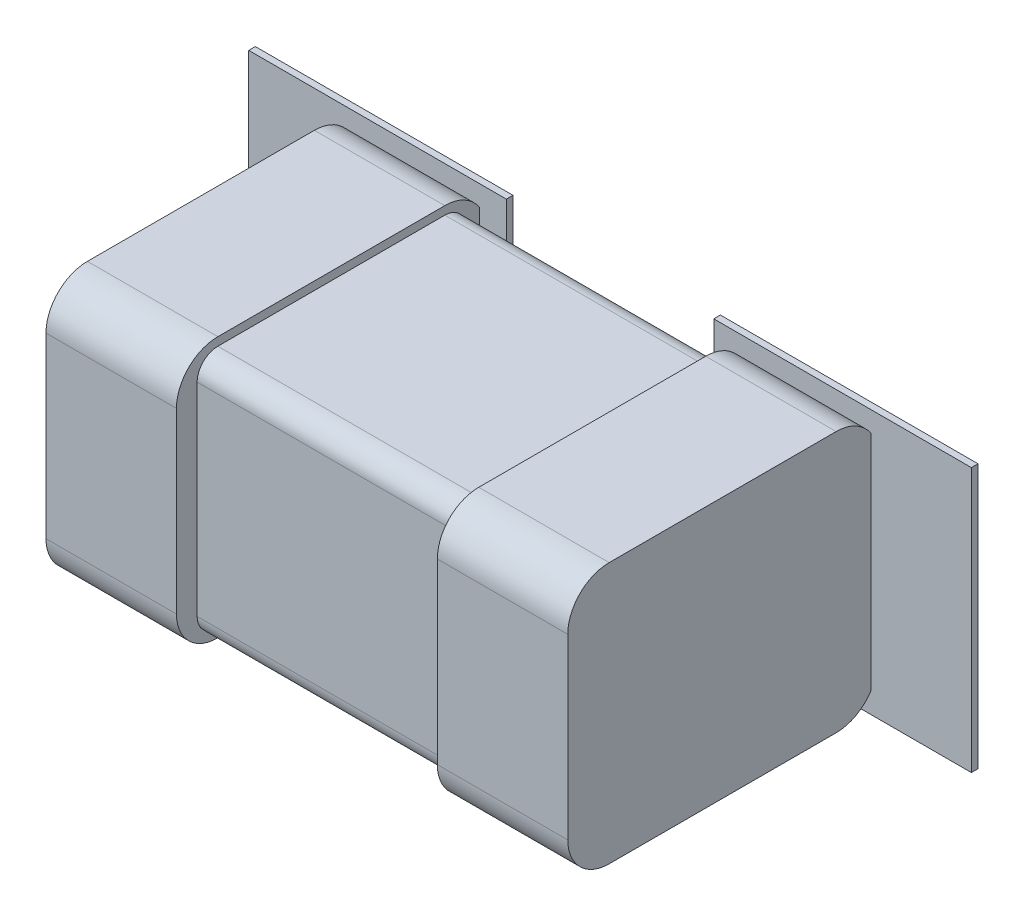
ISO-10303-21;
HEADER;
FILE_DESCRIPTION(('STEP AP214'),'2;1');
FILE_NAME('part.step','',(''),(''),'','','');
FILE_SCHEMA(('AUTOMOTIVE_DESIGN { 1 0 10303 214 1 1 1 1 }'));
ENDSEC;
DATA;
#1=APPLICATION_CONTEXT('core data for automotive mechanical design processes');
#2=APPLICATION_PROTOCOL_DEFINITION('international standard','automotive_design',2000,#1);
#3=PRODUCT_CONTEXT('',#1,'mechanical');
#4=PRODUCT('Part','Part','',(#3));
#5=PRODUCT_RELATED_PRODUCT_CATEGORY('part','',(#4));
#6=PRODUCT_DEFINITION_FORMATION('','',#4);
#7=PRODUCT_DEFINITION_CONTEXT('part definition',#1,'design');
#8=PRODUCT_DEFINITION('design','',#6,#7);
#9=PRODUCT_DEFINITION_SHAPE('','',#8);
#10=(LENGTH_UNIT() NAMED_UNIT(*) SI_UNIT(.MILLI.,.METRE.));
#11=(NAMED_UNIT(*) PLANE_ANGLE_UNIT() SI_UNIT($,.RADIAN.));
#12=(NAMED_UNIT(*) SI_UNIT($,.STERADIAN.) SOLID_ANGLE_UNIT());
#13=UNCERTAINTY_MEASURE_WITH_UNIT(LENGTH_MEASURE(1.E-05),#10,'distance_accuracy_value','');
#14=(GEOMETRIC_REPRESENTATION_CONTEXT(3) GLOBAL_UNCERTAINTY_ASSIGNED_CONTEXT((#13)) GLOBAL_UNIT_ASSIGNED_CONTEXT((#10,
#11,#12)) REPRESENTATION_CONTEXT('',''));
#15=CARTESIAN_POINT('',(0.,0.,0.));
#16=DIRECTION('',(0.,0.,1.));
#17=DIRECTION('',(1.,0.,0.));
#18=AXIS2_PLACEMENT_3D('',#15,#16,#17);
#19=CARTESIAN_POINT('',(0.,0.,0.0762));
#20=DIRECTION('',(0.,0.,1.));
#21=DIRECTION('',(1.,0.,0.));
#22=AXIS2_PLACEMENT_3D('',#19,#20,#21);
#23=PLANE('',#22);
#24=DIRECTION('',(0.,1.,0.));
#25=VECTOR('',#24,1.);
#26=CARTESIAN_POINT('',(0.318008,0.405003,0.0762));
#27=LINE('',#26,#25);
#28=CARTESIAN_POINT('',(0.318008,0.405003,0.0762));
#29=VERTEX_POINT('',#28);
#30=CARTESIAN_POINT('',(0.318008,-0.405003,0.0762));
#31=VERTEX_POINT('',#30);
#32=EDGE_CURVE('E228',#29,#31,#27,.F.);
#33=ORIENTED_EDGE('',*,*,#32,.F.);
#34=DIRECTION('',(1.,0.,0.));
#35=VECTOR('',#34,1.);
#36=CARTESIAN_POINT('',(1.1079988,0.405003,0.0762));
#37=LINE('',#36,#35);
#38=CARTESIAN_POINT('',(1.1079988,0.405003,0.0762));
#39=VERTEX_POINT('',#38);
#40=EDGE_CURVE('E215',#39,#29,#37,.F.);
#41=ORIENTED_EDGE('',*,*,#40,.F.);
#42=DIRECTION('',(0.,1.,0.));
#43=VECTOR('',#42,1.);
#44=CARTESIAN_POINT('',(1.1079988,-0.405003,0.0762));
#45=LINE('',#44,#43);
#46=CARTESIAN_POINT('',(1.1079988,-0.405003,0.0762));
#47=VERTEX_POINT('',#46);
#48=EDGE_CURVE('E356',#47,#39,#45,.T.);
#49=ORIENTED_EDGE('',*,*,#48,.F.);
#50=DIRECTION('',(1.,0.,0.));
#51=VECTOR('',#50,1.);
#52=CARTESIAN_POINT('',(0.318008,-0.405003,0.0762));
#53=LINE('',#52,#51);
#54=EDGE_CURVE('E229',#31,#47,#53,.T.);
#55=ORIENTED_EDGE('',*,*,#54,.F.);
#56=EDGE_LOOP('',(#33,#41,#49,#55));
#57=FACE_BOUND('',#56,.T.);
#58=ADVANCED_FACE('F16',(#57),#23,.F.);
#59=CARTESIAN_POINT('',(1.1079988,0.405003,0.0762));
#60=DIRECTION('',(0.,1.,0.));
#61=DIRECTION('',(0.,0.,1.));
#62=AXIS2_PLACEMENT_3D('',#59,#60,#61);
#63=PLANE('',#62);
#64=DIRECTION('',(0.,0.,-1.));
#65=VECTOR('',#64,1.);
#66=CARTESIAN_POINT('',(1.1079988,0.405003,0.0762));
#67=LINE('',#66,#65);
#68=CARTESIAN_POINT('',(1.1079988,0.405003,0.09652));
#69=VERTEX_POINT('',#68);
#70=EDGE_CURVE('E222',#39,#69,#67,.F.);
#71=ORIENTED_EDGE('',*,*,#70,.F.);
#72=ORIENTED_EDGE('',*,*,#40,.T.);
#73=DIRECTION('',(0.,0.,1.));
#74=VECTOR('',#73,1.);
#75=CARTESIAN_POINT('',(0.318008,0.405003,0.0762));
#76=LINE('',#75,#74);
#77=CARTESIAN_POINT('',(0.318008,0.405003,0.09652));
#78=VERTEX_POINT('',#77);
#79=EDGE_CURVE('E219',#78,#29,#76,.F.);
#80=ORIENTED_EDGE('',*,*,#79,.F.);
#81=DIRECTION('',(1.,0.,0.));
#82=VECTOR('',#81,1.);
#83=CARTESIAN_POINT('',(0.,0.405003,0.09652));
#84=LINE('',#83,#82);
#85=EDGE_CURVE('E354',#69,#78,#84,.F.);
#86=ORIENTED_EDGE('',*,*,#85,.F.);
#87=EDGE_LOOP('',(#71,#72,#80,#86));
#88=FACE_BOUND('',#87,.T.);
#89=ADVANCED_FACE('F217',(#88),#63,.T.);
#90=CARTESIAN_POINT('',(0.318008,0.405003,0.0762));
#91=DIRECTION('',(-1.,0.,0.));
#92=DIRECTION('',(0.,0.,1.));
#93=AXIS2_PLACEMENT_3D('',#90,#91,#92);
#94=PLANE('',#93);
#95=ORIENTED_EDGE('',*,*,#79,.T.);
#96=ORIENTED_EDGE('',*,*,#32,.T.);
#97=DIRECTION('',(0.,0.,-1.));
#98=VECTOR('',#97,1.);
#99=CARTESIAN_POINT('',(0.318008,-0.405003,0.0762));
#100=LINE('',#99,#98);
#101=CARTESIAN_POINT('',(0.318008,-0.405003,0.09652));
#102=VERTEX_POINT('',#101);
#103=EDGE_CURVE('E232',#102,#31,#100,.T.);
#104=ORIENTED_EDGE('',*,*,#103,.F.);
#105=DIRECTION('',(0.,1.,0.));
#106=VECTOR('',#105,1.);
#107=CARTESIAN_POINT('',(0.318008,0.,0.09652));
#108=LINE('',#107,#106);
#109=EDGE_CURVE('E236',#78,#102,#108,.F.);
#110=ORIENTED_EDGE('',*,*,#109,.F.);
#111=EDGE_LOOP('',(#95,#96,#104,#110));
#112=FACE_BOUND('',#111,.T.);
#113=ADVANCED_FACE('F234',(#112),#94,.T.);
#114=CARTESIAN_POINT('',(0.318008,-0.405003,0.0762));
#115=DIRECTION('',(0.,-1.,0.));
#116=DIRECTION('',(0.,0.,-1.));
#117=AXIS2_PLACEMENT_3D('',#114,#115,#116);
#118=PLANE('',#117);
#119=ORIENTED_EDGE('',*,*,#103,.T.);
#120=ORIENTED_EDGE('',*,*,#54,.T.);
#121=DIRECTION('',(0.,0.,-1.));
#122=VECTOR('',#121,1.);
#123=CARTESIAN_POINT('',(1.1079988,-0.405003,0.0762));
#124=LINE('',#123,#122);
#125=CARTESIAN_POINT('',(1.1079988,-0.405003,0.09652));
#126=VERTEX_POINT('',#125);
#127=EDGE_CURVE('E191',#126,#47,#124,.T.);
#128=ORIENTED_EDGE('',*,*,#127,.F.);
#129=DIRECTION('',(1.,0.,0.));
#130=VECTOR('',#129,1.);
#131=CARTESIAN_POINT('',(0.,-0.405003,0.09652));
#132=LINE('',#131,#130);
#133=EDGE_CURVE('E350',#102,#126,#132,.T.);
#134=ORIENTED_EDGE('',*,*,#133,.F.);
#135=EDGE_LOOP('',(#119,#120,#128,#134));
#136=FACE_BOUND('',#135,.T.);
#137=ADVANCED_FACE('F367',(#136),#118,.T.);
#138=CARTESIAN_POINT('',(1.1079988,-0.405003,0.0762));
#139=DIRECTION('',(1.,0.,0.));
#140=DIRECTION('',(0.,0.,-1.));
#141=AXIS2_PLACEMENT_3D('',#138,#139,#140);
#142=PLANE('',#141);
#143=ORIENTED_EDGE('',*,*,#127,.T.);
#144=ORIENTED_EDGE('',*,*,#48,.T.);
#145=ORIENTED_EDGE('',*,*,#70,.T.);
#146=DIRECTION('',(0.,1.,0.));
#147=VECTOR('',#146,1.);
#148=CARTESIAN_POINT('',(1.1079988,0.,0.09652));
#149=LINE('',#148,#147);
#150=EDGE_CURVE('E347',#126,#69,#149,.T.);
#151=ORIENTED_EDGE('',*,*,#150,.F.);
#152=EDGE_LOOP('',(#143,#144,#145,#151));
#153=FACE_BOUND('',#152,.T.);
#154=ADVANCED_FACE('F371',(#153),#142,.T.);
#155=CARTESIAN_POINT('',(0.800000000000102,-0.399999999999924,0.0762));
#156=DIRECTION('',(1.,0.,0.));
#157=DIRECTION('',(0.,0.,-1.));
#158=AXIS2_PLACEMENT_3D('',#155,#156,#157);
#159=PLANE('',#158);
#160=CARTESIAN_POINT('',(0.800000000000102,-0.272999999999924,0.2032));
#161=DIRECTION('',(1.,0.,0.));
#162=DIRECTION('',(0.,0.,-1.));
#163=AXIS2_PLACEMENT_3D('',#160,#161,#162);
#164=CIRCLE('',#163,0.127);
#165=CARTESIAN_POINT('',(0.800000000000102,-0.341908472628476,0.0965199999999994));
#166=VERTEX_POINT('',#165);
#167=CARTESIAN_POINT('',(0.800000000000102,-0.399999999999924,0.2032));
#168=VERTEX_POINT('',#167);
#169=EDGE_CURVE('E318',#166,#168,#164,.F.);
#170=ORIENTED_EDGE('',*,*,#169,.F.);
#171=DIRECTION('',(0.,1.,0.));
#172=VECTOR('',#171,1.);
#173=CARTESIAN_POINT('',(0.800000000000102,0.,0.09652));
#174=LINE('',#173,#172);
#175=CARTESIAN_POINT('',(0.800000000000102,0.341908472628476,0.0965199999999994));
#176=VERTEX_POINT('',#175);
#177=EDGE_CURVE('E182',#176,#166,#174,.F.);
#178=ORIENTED_EDGE('',*,*,#177,.F.);
#179=CARTESIAN_POINT('',(0.800000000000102,0.272999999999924,0.2032));
#180=DIRECTION('',(1.,0.,0.));
#181=DIRECTION('',(0.,0.,-1.));
#182=AXIS2_PLACEMENT_3D('',#179,#180,#181);
#183=CIRCLE('',#182,0.127);
#184=CARTESIAN_POINT('',(0.800000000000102,0.399999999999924,0.2032));
#185=VERTEX_POINT('',#184);
#186=EDGE_CURVE('E19',#185,#176,#183,.F.);
#187=ORIENTED_EDGE('',*,*,#186,.F.);
#188=DIRECTION('',(0.,0.,1.));
#189=VECTOR('',#188,1.);
#190=CARTESIAN_POINT('',(0.800000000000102,0.399999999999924,0.0762));
#191=LINE('',#190,#189);
#192=CARTESIAN_POINT('',(0.800000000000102,0.399999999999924,0.89916));
#193=VERTEX_POINT('',#192);
#194=EDGE_CURVE('E336',#193,#185,#191,.F.);
#195=ORIENTED_EDGE('',*,*,#194,.F.);
#196=CARTESIAN_POINT('',(0.800000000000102,0.272999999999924,0.89916));
#197=DIRECTION('',(-1.,0.,0.));
#198=DIRECTION('',(0.,0.,1.));
#199=AXIS2_PLACEMENT_3D('',#196,#197,#198);
#200=CIRCLE('',#199,0.127);
#201=CARTESIAN_POINT('',(0.800000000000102,0.272999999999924,1.02616));
#202=VERTEX_POINT('',#201);
#203=EDGE_CURVE('E326',#202,#193,#200,.T.);
#204=ORIENTED_EDGE('',*,*,#203,.F.);
#205=DIRECTION('',(0.,1.,0.));
#206=VECTOR('',#205,1.);
#207=CARTESIAN_POINT('',(0.800000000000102,0.,1.02616));
#208=LINE('',#207,#206);
#209=CARTESIAN_POINT('',(0.800000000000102,-0.272999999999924,1.02616));
#210=VERTEX_POINT('',#209);
#211=EDGE_CURVE('E333',#210,#202,#208,.T.);
#212=ORIENTED_EDGE('',*,*,#211,.F.);
#213=CARTESIAN_POINT('',(0.800000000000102,-0.272999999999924,0.89916));
#214=DIRECTION('',(1.,0.,0.));
#215=DIRECTION('',(0.,0.,-1.));
#216=AXIS2_PLACEMENT_3D('',#213,#214,#215);
#217=CIRCLE('',#216,0.127);
#218=CARTESIAN_POINT('',(0.800000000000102,-0.399999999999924,0.89916));
#219=VERTEX_POINT('',#218);
#220=EDGE_CURVE('E322',#219,#210,#217,.F.);
#221=ORIENTED_EDGE('',*,*,#220,.F.);
#222=DIRECTION('',(0.,0.,-1.));
#223=VECTOR('',#222,1.);
#224=CARTESIAN_POINT('',(0.800000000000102,-0.399999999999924,0.0762));
#225=LINE('',#224,#223);
#226=EDGE_CURVE('E324',#168,#219,#225,.F.);
#227=ORIENTED_EDGE('',*,*,#226,.F.);
#228=EDGE_LOOP('',(#170,#178,#187,#195,#204,#212,#221,#227));
#229=FACE_BOUND('',#228,.T.);
#230=ADVANCED_FACE('F373',(#229),#159,.T.);
#231=CARTESIAN_POINT('',(0.,0.,0.09652));
#232=DIRECTION('',(0.,0.,1.));
#233=DIRECTION('',(1.,0.,0.));
#234=AXIS2_PLACEMENT_3D('',#231,#232,#233);
#235=PLANE('',#234);
#236=DIRECTION('',(1.,0.,0.));
#237=VECTOR('',#236,1.);
#238=CARTESIAN_POINT('',(0.800000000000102,0.341908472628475,0.0965199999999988));
#239=LINE('',#238,#237);
#240=CARTESIAN_POINT('',(0.399999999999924,0.341908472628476,0.0965199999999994));
#241=VERTEX_POINT('',#240);
#242=EDGE_CURVE('E344',#176,#241,#239,.F.);
#243=ORIENTED_EDGE('',*,*,#242,.F.);
#244=ORIENTED_EDGE('',*,*,#177,.T.);
#245=DIRECTION('',(1.,0.,0.));
#246=VECTOR('',#245,1.);
#247=CARTESIAN_POINT('',(0.800000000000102,-0.341908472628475,0.0965199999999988));
#248=LINE('',#247,#246);
#249=CARTESIAN_POINT('',(0.399999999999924,-0.341908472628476,0.0965199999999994));
#250=VERTEX_POINT('',#249);
#251=EDGE_CURVE('E321',#250,#166,#248,.T.);
#252=ORIENTED_EDGE('',*,*,#251,.F.);
#253=DIRECTION('',(0.,1.,0.));
#254=VECTOR('',#253,1.);
#255=CARTESIAN_POINT('',(0.399999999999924,0.374599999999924,0.09652));
#256=LINE('',#255,#254);
#257=EDGE_CURVE('E317',#250,#241,#256,.T.);
#258=ORIENTED_EDGE('',*,*,#257,.T.);
#259=EDGE_LOOP('',(#243,#244,#252,#258));
#260=FACE_BOUND('',#259,.T.);
#261=ORIENTED_EDGE('',*,*,#133,.T.);
#262=ORIENTED_EDGE('',*,*,#150,.T.);
#263=ORIENTED_EDGE('',*,*,#85,.T.);
#264=ORIENTED_EDGE('',*,*,#109,.T.);
#265=EDGE_LOOP('',(#261,#262,#263,#264));
#266=FACE_BOUND('',#265,.T.);
#267=ADVANCED_FACE('F369',(#260,#266),#235,.T.);
#268=CARTESIAN_POINT('',(0.800000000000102,0.272999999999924,0.2032));
#269=DIRECTION('',(1.,0.,0.));
#270=DIRECTION('',(0.,0.,-1.));
#271=AXIS2_PLACEMENT_3D('',#268,#269,#270);
#272=CYLINDRICAL_SURFACE('',#271,0.127);
#273=DIRECTION('',(1.,0.,0.));
#274=VECTOR('',#273,1.);
#275=CARTESIAN_POINT('',(0.800000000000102,0.399999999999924,0.2032));
#276=LINE('',#275,#274);
#277=CARTESIAN_POINT('',(0.399999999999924,0.399999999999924,0.2032));
#278=VERTEX_POINT('',#277);
#279=EDGE_CURVE('E329',#185,#278,#276,.F.);
#280=ORIENTED_EDGE('',*,*,#279,.F.);
#281=ORIENTED_EDGE('',*,*,#186,.T.);
#282=ORIENTED_EDGE('',*,*,#242,.T.);
#283=CARTESIAN_POINT('',(0.399999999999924,0.272999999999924,0.2032));
#284=DIRECTION('',(1.,0.,0.));
#285=DIRECTION('',(0.,0.,-1.));
#286=AXIS2_PLACEMENT_3D('',#283,#284,#285);
#287=CIRCLE('',#286,0.127);
#288=EDGE_CURVE('E315',#241,#278,#287,.T.);
#289=ORIENTED_EDGE('',*,*,#288,.T.);
#290=EDGE_LOOP('',(#280,#281,#282,#289));
#291=FACE_BOUND('',#290,.T.);
#292=ADVANCED_FACE('F502',(#291),#272,.T.);
#293=CARTESIAN_POINT('',(0.800000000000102,0.399999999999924,0.0762));
#294=DIRECTION('',(0.,1.,0.));
#295=DIRECTION('',(0.,0.,1.));
#296=AXIS2_PLACEMENT_3D('',#293,#294,#295);
#297=PLANE('',#296);
#298=ORIENTED_EDGE('',*,*,#194,.T.);
#299=ORIENTED_EDGE('',*,*,#279,.T.);
#300=DIRECTION('',(0.,0.,-1.));
#301=VECTOR('',#300,1.);
#302=CARTESIAN_POINT('',(0.399999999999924,0.399999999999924,1.02616));
#303=LINE('',#302,#301);
#304=CARTESIAN_POINT('',(0.399999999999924,0.399999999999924,0.89916));
#305=VERTEX_POINT('',#304);
#306=EDGE_CURVE('E314',#278,#305,#303,.F.);
#307=ORIENTED_EDGE('',*,*,#306,.T.);
#308=DIRECTION('',(-1.,0.,0.));
#309=VECTOR('',#308,1.);
#310=CARTESIAN_POINT('',(0.803760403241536,0.399999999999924,0.89916));
#311=LINE('',#310,#309);
#312=EDGE_CURVE('E328',#193,#305,#311,.T.);
#313=ORIENTED_EDGE('',*,*,#312,.F.);
#314=EDGE_LOOP('',(#298,#299,#307,#313));
#315=FACE_BOUND('',#314,.T.);
#316=ADVANCED_FACE('F499',(#315),#297,.T.);
#317=CARTESIAN_POINT('',(0.803760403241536,0.272999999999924,0.89916));
#318=DIRECTION('',(-1.,0.,0.));
#319=DIRECTION('',(0.,0.,1.));
#320=AXIS2_PLACEMENT_3D('',#317,#318,#319);
#321=CYLINDRICAL_SURFACE('',#320,0.127);
#322=ORIENTED_EDGE('',*,*,#312,.T.);
#323=CARTESIAN_POINT('',(0.399999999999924,0.272999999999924,0.89916));
#324=DIRECTION('',(-1.,0.,0.));
#325=DIRECTION('',(0.,0.,1.));
#326=AXIS2_PLACEMENT_3D('',#323,#324,#325);
#327=CIRCLE('',#326,0.127);
#328=CARTESIAN_POINT('',(0.399999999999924,0.272999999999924,1.02616));
#329=VERTEX_POINT('',#328);
#330=EDGE_CURVE('E312',#305,#329,#327,.F.);
#331=ORIENTED_EDGE('',*,*,#330,.T.);
#332=DIRECTION('',(1.,0.,0.));
#333=VECTOR('',#332,1.);
#334=CARTESIAN_POINT('',(0.,0.272999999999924,1.02616));
#335=LINE('',#334,#333);
#336=EDGE_CURVE('E362',#202,#329,#335,.F.);
#337=ORIENTED_EDGE('',*,*,#336,.F.);
#338=ORIENTED_EDGE('',*,*,#203,.T.);
#339=EDGE_LOOP('',(#322,#331,#337,#338));
#340=FACE_BOUND('',#339,.T.);
#341=ADVANCED_FACE('F495',(#340),#321,.T.);
#342=CARTESIAN_POINT('',(0.,0.,1.02616));
#343=DIRECTION('',(0.,0.,1.));
#344=DIRECTION('',(1.,0.,0.));
#345=AXIS2_PLACEMENT_3D('',#342,#343,#344);
#346=PLANE('',#345);
#347=ORIENTED_EDGE('',*,*,#211,.T.);
#348=ORIENTED_EDGE('',*,*,#336,.T.);
#349=DIRECTION('',(0.,1.,0.));
#350=VECTOR('',#349,1.);
#351=CARTESIAN_POINT('',(0.399999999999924,0.374599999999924,1.02616));
#352=LINE('',#351,#350);
#353=CARTESIAN_POINT('',(0.399999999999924,-0.272999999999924,1.02616));
#354=VERTEX_POINT('',#353);
#355=EDGE_CURVE('E311',#329,#354,#352,.F.);
#356=ORIENTED_EDGE('',*,*,#355,.T.);
#357=DIRECTION('',(1.,0.,0.));
#358=VECTOR('',#357,1.);
#359=CARTESIAN_POINT('',(-0.80391086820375,-0.272999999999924,1.02616));
#360=LINE('',#359,#358);
#361=EDGE_CURVE('E325',#210,#354,#360,.F.);
#362=ORIENTED_EDGE('',*,*,#361,.F.);
#363=EDGE_LOOP('',(#347,#348,#356,#362));
#364=FACE_BOUND('',#363,.T.);
#365=ADVANCED_FACE('F491',(#364),#346,.T.);
#366=CARTESIAN_POINT('',(-0.80391086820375,-0.272999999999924,0.89916));
#367=DIRECTION('',(1.,0.,0.));
#368=DIRECTION('',(0.,0.,-1.));
#369=AXIS2_PLACEMENT_3D('',#366,#367,#368);
#370=CYLINDRICAL_SURFACE('',#369,0.127);
#371=DIRECTION('',(1.,0.,0.));
#372=VECTOR('',#371,1.);
#373=CARTESIAN_POINT('',(-0.800000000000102,-0.399999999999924,0.89916));
#374=LINE('',#373,#372);
#375=CARTESIAN_POINT('',(0.399999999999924,-0.399999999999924,0.89916));
#376=VERTEX_POINT('',#375);
#377=EDGE_CURVE('E360',#219,#376,#374,.F.);
#378=ORIENTED_EDGE('',*,*,#377,.F.);
#379=ORIENTED_EDGE('',*,*,#220,.T.);
#380=ORIENTED_EDGE('',*,*,#361,.T.);
#381=CARTESIAN_POINT('',(0.399999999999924,-0.272999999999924,0.89916));
#382=DIRECTION('',(1.,0.,0.));
#383=DIRECTION('',(0.,0.,-1.));
#384=AXIS2_PLACEMENT_3D('',#381,#382,#383);
#385=CIRCLE('',#384,0.127);
#386=EDGE_CURVE('E309',#354,#376,#385,.T.);
#387=ORIENTED_EDGE('',*,*,#386,.T.);
#388=EDGE_LOOP('',(#378,#379,#380,#387));
#389=FACE_BOUND('',#388,.T.);
#390=ADVANCED_FACE('F487',(#389),#370,.T.);
#391=CARTESIAN_POINT('',(-0.800000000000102,-0.399999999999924,0.0762));
#392=DIRECTION('',(0.,-1.,0.));
#393=DIRECTION('',(0.,0.,-1.));
#394=AXIS2_PLACEMENT_3D('',#391,#392,#393);
#395=PLANE('',#394);
#396=DIRECTION('',(0.,0.,-1.));
#397=VECTOR('',#396,1.);
#398=CARTESIAN_POINT('',(0.399999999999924,-0.399999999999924,1.02616));
#399=LINE('',#398,#397);
#400=CARTESIAN_POINT('',(0.399999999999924,-0.399999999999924,0.2032));
#401=VERTEX_POINT('',#400);
#402=EDGE_CURVE('E308',#376,#401,#399,.T.);
#403=ORIENTED_EDGE('',*,*,#402,.T.);
#404=DIRECTION('',(1.,0.,0.));
#405=VECTOR('',#404,1.);
#406=CARTESIAN_POINT('',(0.800000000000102,-0.399999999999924,0.2032));
#407=LINE('',#406,#405);
#408=EDGE_CURVE('E525',#168,#401,#407,.F.);
#409=ORIENTED_EDGE('',*,*,#408,.F.);
#410=ORIENTED_EDGE('',*,*,#226,.T.);
#411=ORIENTED_EDGE('',*,*,#377,.T.);
#412=EDGE_LOOP('',(#403,#409,#410,#411));
#413=FACE_BOUND('',#412,.T.);
#414=ADVANCED_FACE('F483',(#413),#395,.T.);
#415=CARTESIAN_POINT('',(0.800000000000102,-0.272999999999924,0.2032));
#416=DIRECTION('',(1.,0.,0.));
#417=DIRECTION('',(0.,0.,-1.));
#418=AXIS2_PLACEMENT_3D('',#415,#416,#417);
#419=CYLINDRICAL_SURFACE('',#418,0.127);
#420=ORIENTED_EDGE('',*,*,#251,.T.);
#421=ORIENTED_EDGE('',*,*,#169,.T.);
#422=ORIENTED_EDGE('',*,*,#408,.T.);
#423=CARTESIAN_POINT('',(0.399999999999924,-0.272999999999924,0.2032));
#424=DIRECTION('',(1.,0.,0.));
#425=DIRECTION('',(0.,0.,-1.));
#426=AXIS2_PLACEMENT_3D('',#423,#424,#425);
#427=CIRCLE('',#426,0.127);
#428=EDGE_CURVE('E305',#401,#250,#427,.T.);
#429=ORIENTED_EDGE('',*,*,#428,.T.);
#430=EDGE_LOOP('',(#420,#421,#422,#429));
#431=FACE_BOUND('',#430,.T.);
#432=ADVANCED_FACE('F479',(#431),#419,.T.);
#433=CARTESIAN_POINT('',(0.399999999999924,0.374599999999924,1.02616));
#434=DIRECTION('',(1.,0.,0.));
#435=DIRECTION('',(0.,0.,-1.));
#436=AXIS2_PLACEMENT_3D('',#433,#434,#435);
#437=PLANE('',#436);
#438=DIRECTION('',(0.,0.,1.));
#439=VECTOR('',#438,1.);
#440=CARTESIAN_POINT('',(0.399999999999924,-0.374599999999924,1.02616));
#441=LINE('',#440,#439);
#442=CARTESIAN_POINT('',(0.399999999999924,-0.374599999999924,0.89916));
#443=VERTEX_POINT('',#442);
#444=CARTESIAN_POINT('',(0.399999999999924,-0.374599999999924,0.2032));
#445=VERTEX_POINT('',#444);
#446=EDGE_CURVE('E294',#443,#445,#441,.F.);
#447=ORIENTED_EDGE('',*,*,#446,.T.);
#448=CARTESIAN_POINT('',(0.399999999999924,-0.311099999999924,0.2032));
#449=DIRECTION('',(1.,0.,0.));
#450=DIRECTION('',(0.,0.,-1.));
#451=AXIS2_PLACEMENT_3D('',#448,#449,#450);
#452=CIRCLE('',#451,0.0635);
#453=CARTESIAN_POINT('',(0.399999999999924,-0.311099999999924,0.1397));
#454=VERTEX_POINT('',#453);
#455=EDGE_CURVE('E290',#454,#445,#452,.F.);
#456=ORIENTED_EDGE('',*,*,#455,.F.);
#457=DIRECTION('',(0.,1.,0.));
#458=VECTOR('',#457,1.);
#459=CARTESIAN_POINT('',(0.399999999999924,0.374599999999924,0.1397));
#460=LINE('',#459,#458);
#461=CARTESIAN_POINT('',(0.399999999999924,0.311099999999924,0.1397));
#462=VERTEX_POINT('',#461);
#463=EDGE_CURVE('E536',#454,#462,#460,.T.);
#464=ORIENTED_EDGE('',*,*,#463,.T.);
#465=CARTESIAN_POINT('',(0.399999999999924,0.311099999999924,0.2032));
#466=DIRECTION('',(-1.,0.,0.));
#467=DIRECTION('',(0.,0.,1.));
#468=AXIS2_PLACEMENT_3D('',#465,#466,#467);
#469=CIRCLE('',#468,0.0635);
#470=CARTESIAN_POINT('',(0.399999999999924,0.374599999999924,0.2032));
#471=VERTEX_POINT('',#470);
#472=EDGE_CURVE('E285',#471,#462,#469,.T.);
#473=ORIENTED_EDGE('',*,*,#472,.F.);
#474=DIRECTION('',(0.,0.,-1.));
#475=VECTOR('',#474,1.);
#476=CARTESIAN_POINT('',(0.399999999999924,0.374599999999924,1.02616));
#477=LINE('',#476,#475);
#478=CARTESIAN_POINT('',(0.399999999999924,0.374599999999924,0.89916));
#479=VERTEX_POINT('',#478);
#480=EDGE_CURVE('E304',#471,#479,#477,.F.);
#481=ORIENTED_EDGE('',*,*,#480,.T.);
#482=CARTESIAN_POINT('',(0.399999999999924,0.311099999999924,0.89916));
#483=DIRECTION('',(1.,0.,0.));
#484=DIRECTION('',(0.,0.,-1.));
#485=AXIS2_PLACEMENT_3D('',#482,#483,#484);
#486=CIRCLE('',#485,0.0635);
#487=CARTESIAN_POINT('',(0.399999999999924,0.311099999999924,0.96266));
#488=VERTEX_POINT('',#487);
#489=EDGE_CURVE('E300',#488,#479,#486,.F.);
#490=ORIENTED_EDGE('',*,*,#489,.F.);
#491=DIRECTION('',(0.,1.,0.));
#492=VECTOR('',#491,1.);
#493=CARTESIAN_POINT('',(0.399999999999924,0.374599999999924,0.96266));
#494=LINE('',#493,#492);
#495=CARTESIAN_POINT('',(0.399999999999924,-0.311099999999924,0.96266));
#496=VERTEX_POINT('',#495);
#497=EDGE_CURVE('E299',#488,#496,#494,.F.);
#498=ORIENTED_EDGE('',*,*,#497,.T.);
#499=CARTESIAN_POINT('',(0.399999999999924,-0.311099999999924,0.89916));
#500=DIRECTION('',(-1.,0.,0.));
#501=DIRECTION('',(0.,0.,1.));
#502=AXIS2_PLACEMENT_3D('',#499,#500,#501);
#503=CIRCLE('',#502,0.0635);
#504=EDGE_CURVE('E295',#443,#496,#503,.T.);
#505=ORIENTED_EDGE('',*,*,#504,.F.);
#506=EDGE_LOOP('',(#447,#456,#464,#473,#481,#490,#498,#505));
#507=FACE_BOUND('',#506,.T.);
#508=ORIENTED_EDGE('',*,*,#402,.F.);
#509=ORIENTED_EDGE('',*,*,#386,.F.);
#510=ORIENTED_EDGE('',*,*,#355,.F.);
#511=ORIENTED_EDGE('',*,*,#330,.F.);
#512=ORIENTED_EDGE('',*,*,#306,.F.);
#513=ORIENTED_EDGE('',*,*,#288,.F.);
#514=ORIENTED_EDGE('',*,*,#257,.F.);
#515=ORIENTED_EDGE('',*,*,#428,.F.);
#516=EDGE_LOOP('',(#508,#509,#510,#511,#512,#513,#514,#515));
#517=FACE_BOUND('',#516,.T.);
#518=ADVANCED_FACE('F475',(#507,#517),#437,.F.);
#519=CARTESIAN_POINT('',(0.,0.,0.0762));
#520=DIRECTION('',(0.,0.,1.));
#521=DIRECTION('',(1.,0.,0.));
#522=AXIS2_PLACEMENT_3D('',#519,#520,#521);
#523=PLANE('',#522);
#524=DIRECTION('',(0.,1.,0.));
#525=VECTOR('',#524,1.);
#526=CARTESIAN_POINT('',(-0.318008,-0.405003,0.0762));
#527=LINE('',#526,#525);
#528=CARTESIAN_POINT('',(-0.318008,-0.405003,0.0762));
#529=VERTEX_POINT('',#528);
#530=CARTESIAN_POINT('',(-0.318008,0.405003,0.0762));
#531=VERTEX_POINT('',#530);
#532=EDGE_CURVE('E576',#529,#531,#527,.T.);
#533=ORIENTED_EDGE('',*,*,#532,.F.);
#534=DIRECTION('',(1.,0.,0.));
#535=VECTOR('',#534,1.);
#536=CARTESIAN_POINT('',(-1.1079988,-0.405003,0.0762));
#537=LINE('',#536,#535);
#538=CARTESIAN_POINT('',(-1.1079988,-0.405003,0.0762));
#539=VERTEX_POINT('',#538);
#540=EDGE_CURVE('E564',#539,#529,#537,.T.);
#541=ORIENTED_EDGE('',*,*,#540,.F.);
#542=DIRECTION('',(0.,1.,0.));
#543=VECTOR('',#542,1.);
#544=CARTESIAN_POINT('',(-1.1079988,0.405003,0.0762));
#545=LINE('',#544,#543);
#546=CARTESIAN_POINT('',(-1.1079988,0.405003,0.0762));
#547=VERTEX_POINT('',#546);
#548=EDGE_CURVE('E591',#547,#539,#545,.F.);
#549=ORIENTED_EDGE('',*,*,#548,.F.);
#550=DIRECTION('',(1.,0.,0.));
#551=VECTOR('',#550,1.);
#552=CARTESIAN_POINT('',(-0.318008,0.405003,0.0762));
#553=LINE('',#552,#551);
#554=EDGE_CURVE('E582',#531,#547,#553,.F.);
#555=ORIENTED_EDGE('',*,*,#554,.F.);
#556=EDGE_LOOP('',(#533,#541,#549,#555));
#557=FACE_BOUND('',#556,.T.);
#558=ADVANCED_FACE('F471',(#557),#523,.F.);
#559=CARTESIAN_POINT('',(-0.399999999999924,0.374599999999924,1.02616));
#560=DIRECTION('',(0.,-1.,0.));
#561=DIRECTION('',(0.,0.,-1.));
#562=AXIS2_PLACEMENT_3D('',#559,#560,#561);
#563=PLANE('',#562);
#564=DIRECTION('',(1.,0.,0.));
#565=VECTOR('',#564,1.);
#566=CARTESIAN_POINT('',(-0.404099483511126,0.374599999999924,0.89916));
#567=LINE('',#566,#565);
#568=CARTESIAN_POINT('',(-0.399999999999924,0.374599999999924,0.89916));
#569=VERTEX_POINT('',#568);
#570=EDGE_CURVE('E303',#479,#569,#567,.F.);
#571=ORIENTED_EDGE('',*,*,#570,.F.);
#572=ORIENTED_EDGE('',*,*,#480,.F.);
#573=DIRECTION('',(-1.,0.,0.));
#574=VECTOR('',#573,1.);
#575=CARTESIAN_POINT('',(0.403760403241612,0.374599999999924,0.2032));
#576=LINE('',#575,#574);
#577=CARTESIAN_POINT('',(-0.399999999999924,0.374599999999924,0.2032));
#578=VERTEX_POINT('',#577);
#579=EDGE_CURVE('E289',#578,#471,#576,.F.);
#580=ORIENTED_EDGE('',*,*,#579,.F.);
#581=DIRECTION('',(0.,0.,1.));
#582=VECTOR('',#581,1.);
#583=CARTESIAN_POINT('',(-0.399999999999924,0.374599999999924,1.02616));
#584=LINE('',#583,#582);
#585=EDGE_CURVE('E284',#578,#569,#584,.T.);
#586=ORIENTED_EDGE('',*,*,#585,.T.);
#587=EDGE_LOOP('',(#571,#572,#580,#586));
#588=FACE_BOUND('',#587,.T.);
#589=ADVANCED_FACE('F467',(#588),#563,.F.);
#590=CARTESIAN_POINT('',(-0.404099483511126,0.311099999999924,0.89916));
#591=DIRECTION('',(1.,0.,0.));
#592=DIRECTION('',(0.,0.,-1.));
#593=AXIS2_PLACEMENT_3D('',#590,#591,#592);
#594=CYLINDRICAL_SURFACE('',#593,0.0635);
#595=CARTESIAN_POINT('',(-0.399999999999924,0.311099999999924,0.89916));
#596=DIRECTION('',(1.,0.,0.));
#597=DIRECTION('',(0.,0.,-1.));
#598=AXIS2_PLACEMENT_3D('',#595,#596,#597);
#599=CIRCLE('',#598,0.0635);
#600=CARTESIAN_POINT('',(-0.399999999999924,0.311099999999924,0.96266));
#601=VERTEX_POINT('',#600);
#602=EDGE_CURVE('E282',#569,#601,#599,.T.);
#603=ORIENTED_EDGE('',*,*,#602,.T.);
#604=DIRECTION('',(-1.,0.,0.));
#605=VECTOR('',#604,1.);
#606=CARTESIAN_POINT('',(0.399999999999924,0.311099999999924,0.96266));
#607=LINE('',#606,#605);
#608=EDGE_CURVE('E543',#601,#488,#607,.F.);
#609=ORIENTED_EDGE('',*,*,#608,.T.);
#610=ORIENTED_EDGE('',*,*,#489,.T.);
#611=ORIENTED_EDGE('',*,*,#570,.T.);
#612=EDGE_LOOP('',(#603,#609,#610,#611));
#613=FACE_BOUND('',#612,.T.);
#614=ADVANCED_FACE('F463',(#613),#594,.T.);
#615=CARTESIAN_POINT('',(0.399999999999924,0.374599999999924,0.96266));
#616=DIRECTION('',(0.,0.,-1.));
#617=DIRECTION('',(-1.,0.,0.));
#618=AXIS2_PLACEMENT_3D('',#615,#616,#617);
#619=PLANE('',#618);
#620=DIRECTION('',(-1.,0.,0.));
#621=VECTOR('',#620,1.);
#622=CARTESIAN_POINT('',(0.403910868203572,-0.311099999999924,0.96266));
#623=LINE('',#622,#621);
#624=CARTESIAN_POINT('',(-0.399999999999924,-0.311099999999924,0.96266));
#625=VERTEX_POINT('',#624);
#626=EDGE_CURVE('E298',#496,#625,#623,.T.);
#627=ORIENTED_EDGE('',*,*,#626,.F.);
#628=ORIENTED_EDGE('',*,*,#497,.F.);
#629=ORIENTED_EDGE('',*,*,#608,.F.);
#630=DIRECTION('',(0.,1.,0.));
#631=VECTOR('',#630,1.);
#632=CARTESIAN_POINT('',(-0.399999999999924,0.399999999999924,0.96266));
#633=LINE('',#632,#631);
#634=EDGE_CURVE('E281',#601,#625,#633,.F.);
#635=ORIENTED_EDGE('',*,*,#634,.T.);
#636=EDGE_LOOP('',(#627,#628,#629,#635));
#637=FACE_BOUND('',#636,.T.);
#638=ADVANCED_FACE('F459',(#637),#619,.F.);
#639=CARTESIAN_POINT('',(0.403910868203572,-0.311099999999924,0.89916));
#640=DIRECTION('',(-1.,0.,0.));
#641=DIRECTION('',(0.,0.,1.));
#642=AXIS2_PLACEMENT_3D('',#639,#640,#641);
#643=CYLINDRICAL_SURFACE('',#642,0.0635);
#644=ORIENTED_EDGE('',*,*,#504,.T.);
#645=ORIENTED_EDGE('',*,*,#626,.T.);
#646=CARTESIAN_POINT('',(-0.399999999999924,-0.311099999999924,0.89916));
#647=DIRECTION('',(-1.,0.,0.));
#648=DIRECTION('',(0.,0.,1.));
#649=AXIS2_PLACEMENT_3D('',#646,#647,#648);
#650=CIRCLE('',#649,0.0635);
#651=CARTESIAN_POINT('',(-0.399999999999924,-0.374599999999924,0.89916));
#652=VERTEX_POINT('',#651);
#653=EDGE_CURVE('E279',#625,#652,#650,.F.);
#654=ORIENTED_EDGE('',*,*,#653,.T.);
#655=DIRECTION('',(1.,0.,0.));
#656=VECTOR('',#655,1.);
#657=CARTESIAN_POINT('',(0.399999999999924,-0.374599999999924,0.89916));
#658=LINE('',#657,#656);
#659=EDGE_CURVE('E542',#652,#443,#658,.T.);
#660=ORIENTED_EDGE('',*,*,#659,.T.);
#661=EDGE_LOOP('',(#644,#645,#654,#660));
#662=FACE_BOUND('',#661,.T.);
#663=ADVANCED_FACE('F455',(#662),#643,.T.);
#664=CARTESIAN_POINT('',(0.399999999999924,-0.374599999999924,1.02616));
#665=DIRECTION('',(0.,1.,0.));
#666=DIRECTION('',(0.,0.,1.));
#667=AXIS2_PLACEMENT_3D('',#664,#665,#666);
#668=PLANE('',#667);
#669=DIRECTION('',(1.,0.,0.));
#670=VECTOR('',#669,1.);
#671=CARTESIAN_POINT('',(-0.403760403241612,-0.374599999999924,0.2032));
#672=LINE('',#671,#670);
#673=CARTESIAN_POINT('',(-0.399999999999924,-0.374599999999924,0.2032));
#674=VERTEX_POINT('',#673);
#675=EDGE_CURVE('E293',#445,#674,#672,.F.);
#676=ORIENTED_EDGE('',*,*,#675,.F.);
#677=ORIENTED_EDGE('',*,*,#446,.F.);
#678=ORIENTED_EDGE('',*,*,#659,.F.);
#679=DIRECTION('',(0.,0.,1.));
#680=VECTOR('',#679,1.);
#681=CARTESIAN_POINT('',(-0.399999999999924,-0.374599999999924,1.02616));
#682=LINE('',#681,#680);
#683=EDGE_CURVE('E278',#652,#674,#682,.F.);
#684=ORIENTED_EDGE('',*,*,#683,.T.);
#685=EDGE_LOOP('',(#676,#677,#678,#684));
#686=FACE_BOUND('',#685,.T.);
#687=ADVANCED_FACE('F451',(#686),#668,.F.);
#688=CARTESIAN_POINT('',(-0.403760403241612,-0.311099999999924,0.2032));
#689=DIRECTION('',(1.,0.,0.));
#690=DIRECTION('',(0.,0.,-1.));
#691=AXIS2_PLACEMENT_3D('',#688,#689,#690);
#692=CYLINDRICAL_SURFACE('',#691,0.0635);
#693=CARTESIAN_POINT('',(-0.399999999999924,-0.311099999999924,0.2032));
#694=DIRECTION('',(1.,0.,0.));
#695=DIRECTION('',(0.,0.,-1.));
#696=AXIS2_PLACEMENT_3D('',#693,#694,#695);
#697=CIRCLE('',#696,0.0635);
#698=CARTESIAN_POINT('',(-0.399999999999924,-0.311099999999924,0.1397));
#699=VERTEX_POINT('',#698);
#700=EDGE_CURVE('E276',#674,#699,#697,.T.);
#701=ORIENTED_EDGE('',*,*,#700,.T.);
#702=DIRECTION('',(1.,0.,0.));
#703=VECTOR('',#702,1.);
#704=CARTESIAN_POINT('',(-0.399999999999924,-0.311099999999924,0.1397));
#705=LINE('',#704,#703);
#706=EDGE_CURVE('E557',#699,#454,#705,.T.);
#707=ORIENTED_EDGE('',*,*,#706,.T.);
#708=ORIENTED_EDGE('',*,*,#455,.T.);
#709=ORIENTED_EDGE('',*,*,#675,.T.);
#710=EDGE_LOOP('',(#701,#707,#708,#709));
#711=FACE_BOUND('',#710,.T.);
#712=ADVANCED_FACE('F447',(#711),#692,.T.);
#713=CARTESIAN_POINT('',(-0.399999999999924,0.374599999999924,0.1397));
#714=DIRECTION('',(0.,0.,1.));
#715=DIRECTION('',(1.,0.,0.));
#716=AXIS2_PLACEMENT_3D('',#713,#714,#715);
#717=PLANE('',#716);
#718=ORIENTED_EDGE('',*,*,#706,.F.);
#719=DIRECTION('',(0.,1.,0.));
#720=VECTOR('',#719,1.);
#721=CARTESIAN_POINT('',(-0.399999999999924,0.399999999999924,0.1397));
#722=LINE('',#721,#720);
#723=CARTESIAN_POINT('',(-0.399999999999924,0.311099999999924,0.1397));
#724=VERTEX_POINT('',#723);
#725=EDGE_CURVE('E275',#699,#724,#722,.T.);
#726=ORIENTED_EDGE('',*,*,#725,.T.);
#727=DIRECTION('',(-1.,0.,0.));
#728=VECTOR('',#727,1.);
#729=CARTESIAN_POINT('',(0.403760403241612,0.311099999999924,0.1397));
#730=LINE('',#729,#728);
#731=EDGE_CURVE('E288',#462,#724,#730,.T.);
#732=ORIENTED_EDGE('',*,*,#731,.F.);
#733=ORIENTED_EDGE('',*,*,#463,.F.);
#734=EDGE_LOOP('',(#718,#726,#732,#733));
#735=FACE_BOUND('',#734,.T.);
#736=ADVANCED_FACE('F443',(#735),#717,.F.);
#737=CARTESIAN_POINT('',(0.403760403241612,0.311099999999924,0.2032));
#738=DIRECTION('',(-1.,0.,0.));
#739=DIRECTION('',(0.,0.,1.));
#740=AXIS2_PLACEMENT_3D('',#737,#738,#739);
#741=CYLINDRICAL_SURFACE('',#740,0.0635);
#742=ORIENTED_EDGE('',*,*,#472,.T.);
#743=ORIENTED_EDGE('',*,*,#731,.T.);
#744=CARTESIAN_POINT('',(-0.399999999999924,0.311099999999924,0.2032));
#745=DIRECTION('',(-1.,0.,0.));
#746=DIRECTION('',(0.,0.,1.));
#747=AXIS2_PLACEMENT_3D('',#744,#745,#746);
#748=CIRCLE('',#747,0.0635);
#749=EDGE_CURVE('E272',#724,#578,#748,.F.);
#750=ORIENTED_EDGE('',*,*,#749,.T.);
#751=ORIENTED_EDGE('',*,*,#579,.T.);
#752=EDGE_LOOP('',(#742,#743,#750,#751));
#753=FACE_BOUND('',#752,.T.);
#754=ADVANCED_FACE('F439',(#753),#741,.T.);
#755=CARTESIAN_POINT('',(-1.1079988,-0.405003,0.0762));
#756=DIRECTION('',(0.,-1.,0.));
#757=DIRECTION('',(0.,0.,-1.));
#758=AXIS2_PLACEMENT_3D('',#755,#756,#757);
#759=PLANE('',#758);
#760=DIRECTION('',(0.,0.,1.));
#761=VECTOR('',#760,1.);
#762=CARTESIAN_POINT('',(-1.1079988,-0.405003,0.0762));
#763=LINE('',#762,#761);
#764=CARTESIAN_POINT('',(-1.1079988,-0.405003,0.09652));
#765=VERTEX_POINT('',#764);
#766=EDGE_CURVE('E585',#539,#765,#763,.T.);
#767=ORIENTED_EDGE('',*,*,#766,.F.);
#768=ORIENTED_EDGE('',*,*,#540,.T.);
#769=DIRECTION('',(0.,0.,-1.));
#770=VECTOR('',#769,1.);
#771=CARTESIAN_POINT('',(-0.318008,-0.405003,0.0762));
#772=LINE('',#771,#770);
#773=CARTESIAN_POINT('',(-0.318008,-0.405003,0.09652));
#774=VERTEX_POINT('',#773);
#775=EDGE_CURVE('E573',#774,#529,#772,.T.);
#776=ORIENTED_EDGE('',*,*,#775,.F.);
#777=DIRECTION('',(1.,0.,0.));
#778=VECTOR('',#777,1.);
#779=CARTESIAN_POINT('',(0.,-0.405003,0.09652));
#780=LINE('',#779,#778);
#781=EDGE_CURVE('E258',#765,#774,#780,.T.);
#782=ORIENTED_EDGE('',*,*,#781,.F.);
#783=EDGE_LOOP('',(#767,#768,#776,#782));
#784=FACE_BOUND('',#783,.T.);
#785=ADVANCED_FACE('F435',(#784),#759,.T.);
#786=CARTESIAN_POINT('',(-0.318008,-0.405003,0.0762));
#787=DIRECTION('',(1.,0.,0.));
#788=DIRECTION('',(0.,0.,-1.));
#789=AXIS2_PLACEMENT_3D('',#786,#787,#788);
#790=PLANE('',#789);
#791=ORIENTED_EDGE('',*,*,#775,.T.);
#792=ORIENTED_EDGE('',*,*,#532,.T.);
#793=DIRECTION('',(0.,0.,1.));
#794=VECTOR('',#793,1.);
#795=CARTESIAN_POINT('',(-0.318008,0.405003,0.0762));
#796=LINE('',#795,#794);
#797=CARTESIAN_POINT('',(-0.318008,0.405003,0.09652));
#798=VERTEX_POINT('',#797);
#799=EDGE_CURVE('E579',#798,#531,#796,.F.);
#800=ORIENTED_EDGE('',*,*,#799,.F.);
#801=DIRECTION('',(0.,1.,0.));
#802=VECTOR('',#801,1.);
#803=CARTESIAN_POINT('',(-0.318008,0.,0.09652));
#804=LINE('',#803,#802);
#805=EDGE_CURVE('E619',#774,#798,#804,.T.);
#806=ORIENTED_EDGE('',*,*,#805,.F.);
#807=EDGE_LOOP('',(#791,#792,#800,#806));
#808=FACE_BOUND('',#807,.T.);
#809=ADVANCED_FACE('F431',(#808),#790,.T.);
#810=CARTESIAN_POINT('',(-0.318008,0.405003,0.0762));
#811=DIRECTION('',(0.,1.,0.));
#812=DIRECTION('',(0.,0.,1.));
#813=AXIS2_PLACEMENT_3D('',#810,#811,#812);
#814=PLANE('',#813);
#815=ORIENTED_EDGE('',*,*,#799,.T.);
#816=ORIENTED_EDGE('',*,*,#554,.T.);
#817=DIRECTION('',(0.,0.,1.));
#818=VECTOR('',#817,1.);
#819=CARTESIAN_POINT('',(-1.1079988,0.405003,0.0762));
#820=LINE('',#819,#818);
#821=CARTESIAN_POINT('',(-1.1079988,0.405003,0.09652));
#822=VERTEX_POINT('',#821);
#823=EDGE_CURVE('E588',#822,#547,#820,.F.);
#824=ORIENTED_EDGE('',*,*,#823,.F.);
#825=DIRECTION('',(1.,0.,0.));
#826=VECTOR('',#825,1.);
#827=CARTESIAN_POINT('',(0.,0.405003,0.09652));
#828=LINE('',#827,#826);
#829=EDGE_CURVE('E622',#798,#822,#828,.F.);
#830=ORIENTED_EDGE('',*,*,#829,.F.);
#831=EDGE_LOOP('',(#815,#816,#824,#830));
#832=FACE_BOUND('',#831,.T.);
#833=ADVANCED_FACE('F427',(#832),#814,.T.);
#834=CARTESIAN_POINT('',(-1.1079988,0.405003,0.0762));
#835=DIRECTION('',(-1.,0.,0.));
#836=DIRECTION('',(0.,0.,1.));
#837=AXIS2_PLACEMENT_3D('',#834,#835,#836);
#838=PLANE('',#837);
#839=ORIENTED_EDGE('',*,*,#823,.T.);
#840=ORIENTED_EDGE('',*,*,#548,.T.);
#841=ORIENTED_EDGE('',*,*,#766,.T.);
#842=DIRECTION('',(0.,1.,0.));
#843=VECTOR('',#842,1.);
#844=CARTESIAN_POINT('',(-1.1079988,0.,0.09652));
#845=LINE('',#844,#843);
#846=EDGE_CURVE('E616',#822,#765,#845,.F.);
#847=ORIENTED_EDGE('',*,*,#846,.F.);
#848=EDGE_LOOP('',(#839,#840,#841,#847));
#849=FACE_BOUND('',#848,.T.);
#850=ADVANCED_FACE('F423',(#849),#838,.T.);
#851=CARTESIAN_POINT('',(-0.399999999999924,0.399999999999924,1.02616));
#852=DIRECTION('',(-1.,0.,0.));
#853=DIRECTION('',(0.,0.,1.));
#854=AXIS2_PLACEMENT_3D('',#851,#852,#853);
#855=PLANE('',#854);
#856=ORIENTED_EDGE('',*,*,#725,.F.);
#857=ORIENTED_EDGE('',*,*,#700,.F.);
#858=ORIENTED_EDGE('',*,*,#683,.F.);
#859=ORIENTED_EDGE('',*,*,#653,.F.);
#860=ORIENTED_EDGE('',*,*,#634,.F.);
#861=ORIENTED_EDGE('',*,*,#602,.F.);
#862=ORIENTED_EDGE('',*,*,#585,.F.);
#863=ORIENTED_EDGE('',*,*,#749,.F.);
#864=EDGE_LOOP('',(#856,#857,#858,#859,#860,#861,#862,#863));
#865=FACE_BOUND('',#864,.T.);
#866=DIRECTION('',(0.,0.,1.));
#867=VECTOR('',#866,1.);
#868=CARTESIAN_POINT('',(-0.399999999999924,0.399999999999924,0.0762));
#869=LINE('',#868,#867);
#870=CARTESIAN_POINT('',(-0.399999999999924,0.399999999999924,0.89916));
#871=VERTEX_POINT('',#870);
#872=CARTESIAN_POINT('',(-0.399999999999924,0.399999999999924,0.2032));
#873=VERTEX_POINT('',#872);
#874=EDGE_CURVE('E569',#871,#873,#869,.F.);
#875=ORIENTED_EDGE('',*,*,#874,.F.);
#876=CARTESIAN_POINT('',(-0.399999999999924,0.272999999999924,0.89916));
#877=DIRECTION('',(-1.,0.,0.));
#878=DIRECTION('',(0.,0.,1.));
#879=AXIS2_PLACEMENT_3D('',#876,#877,#878);
#880=CIRCLE('',#879,0.127);
#881=CARTESIAN_POINT('',(-0.399999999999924,0.272999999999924,1.02616));
#882=VERTEX_POINT('',#881);
#883=EDGE_CURVE('E260',#882,#871,#880,.T.);
#884=ORIENTED_EDGE('',*,*,#883,.F.);
#885=DIRECTION('',(0.,1.,0.));
#886=VECTOR('',#885,1.);
#887=CARTESIAN_POINT('',(-0.399999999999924,0.,1.02616));
#888=LINE('',#887,#886);
#889=CARTESIAN_POINT('',(-0.399999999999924,-0.272999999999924,1.02616));
#890=VERTEX_POINT('',#889);
#891=EDGE_CURVE('E567',#890,#882,#888,.T.);
#892=ORIENTED_EDGE('',*,*,#891,.F.);
#893=CARTESIAN_POINT('',(-0.399999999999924,-0.272999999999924,0.89916));
#894=DIRECTION('',(1.,0.,0.));
#895=DIRECTION('',(0.,0.,-1.));
#896=AXIS2_PLACEMENT_3D('',#893,#894,#895);
#897=CIRCLE('',#896,0.127);
#898=CARTESIAN_POINT('',(-0.399999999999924,-0.399999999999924,0.89916));
#899=VERTEX_POINT('',#898);
#900=EDGE_CURVE('E264',#899,#890,#897,.F.);
#901=ORIENTED_EDGE('',*,*,#900,.F.);
#902=DIRECTION('',(0.,0.,-1.));
#903=VECTOR('',#902,1.);
#904=CARTESIAN_POINT('',(-0.399999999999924,-0.399999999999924,0.0762));
#905=LINE('',#904,#903);
#906=CARTESIAN_POINT('',(-0.399999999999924,-0.399999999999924,0.2032));
#907=VERTEX_POINT('',#906);
#908=EDGE_CURVE('E271',#907,#899,#905,.F.);
#909=ORIENTED_EDGE('',*,*,#908,.F.);
#910=CARTESIAN_POINT('',(-0.399999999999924,-0.272999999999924,0.2032));
#911=DIRECTION('',(1.,0.,0.));
#912=DIRECTION('',(0.,0.,-1.));
#913=AXIS2_PLACEMENT_3D('',#910,#911,#912);
#914=CIRCLE('',#913,0.127);
#915=CARTESIAN_POINT('',(-0.399999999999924,-0.341908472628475,0.09652));
#916=VERTEX_POINT('',#915);
#917=EDGE_CURVE('E268',#916,#907,#914,.F.);
#918=ORIENTED_EDGE('',*,*,#917,.F.);
#919=DIRECTION('',(0.,1.,0.));
#920=VECTOR('',#919,1.);
#921=CARTESIAN_POINT('',(-0.399999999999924,0.,0.09652));
#922=LINE('',#921,#920);
#923=CARTESIAN_POINT('',(-0.399999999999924,0.341908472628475,0.09652));
#924=VERTEX_POINT('',#923);
#925=EDGE_CURVE('E598',#924,#916,#922,.F.);
#926=ORIENTED_EDGE('',*,*,#925,.F.);
#927=CARTESIAN_POINT('',(-0.399999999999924,0.272999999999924,0.2032));
#928=DIRECTION('',(1.,0.,0.));
#929=DIRECTION('',(0.,0.,-1.));
#930=AXIS2_PLACEMENT_3D('',#927,#928,#929);
#931=CIRCLE('',#930,0.127);
#932=EDGE_CURVE('E256',#873,#924,#931,.F.);
#933=ORIENTED_EDGE('',*,*,#932,.F.);
#934=EDGE_LOOP('',(#875,#884,#892,#901,#909,#918,#926,#933));
#935=FACE_BOUND('',#934,.T.);
#936=ADVANCED_FACE('F419',(#865,#935),#855,.F.);
#937=CARTESIAN_POINT('',(0.800000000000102,-0.272999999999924,0.2032));
#938=DIRECTION('',(1.,0.,0.));
#939=DIRECTION('',(0.,0.,-1.));
#940=AXIS2_PLACEMENT_3D('',#937,#938,#939);
#941=CYLINDRICAL_SURFACE('',#940,0.127);
#942=DIRECTION('',(1.,0.,0.));
#943=VECTOR('',#942,1.);
#944=CARTESIAN_POINT('',(-0.800000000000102,-0.399999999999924,0.2032));
#945=LINE('',#944,#943);
#946=CARTESIAN_POINT('',(-0.800000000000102,-0.399999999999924,0.2032));
#947=VERTEX_POINT('',#946);
#948=EDGE_CURVE('E566',#947,#907,#945,.T.);
#949=ORIENTED_EDGE('',*,*,#948,.F.);
#950=CARTESIAN_POINT('',(-0.800000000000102,-0.272999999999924,0.2032));
#951=DIRECTION('',(1.,0.,0.));
#952=DIRECTION('',(0.,0.,-1.));
#953=AXIS2_PLACEMENT_3D('',#950,#951,#952);
#954=CIRCLE('',#953,0.127);
#955=CARTESIAN_POINT('',(-0.800000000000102,-0.341908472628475,0.09652));
#956=VERTEX_POINT('',#955);
#957=EDGE_CURVE('E252',#956,#947,#954,.F.);
#958=ORIENTED_EDGE('',*,*,#957,.F.);
#959=DIRECTION('',(1.,0.,0.));
#960=VECTOR('',#959,1.);
#961=CARTESIAN_POINT('',(0.,-0.341908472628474,0.09652));
#962=LINE('',#961,#960);
#963=EDGE_CURVE('E255',#916,#956,#962,.F.);
#964=ORIENTED_EDGE('',*,*,#963,.F.);
#965=ORIENTED_EDGE('',*,*,#917,.T.);
#966=EDGE_LOOP('',(#949,#958,#964,#965));
#967=FACE_BOUND('',#966,.T.);
#968=ADVANCED_FACE('F415',(#967),#941,.T.);
#969=CARTESIAN_POINT('',(-0.800000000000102,-0.399999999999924,0.0762));
#970=DIRECTION('',(0.,-1.,0.));
#971=DIRECTION('',(0.,0.,-1.));
#972=AXIS2_PLACEMENT_3D('',#969,#970,#971);
#973=PLANE('',#972);
#974=DIRECTION('',(0.,0.,1.));
#975=VECTOR('',#974,1.);
#976=CARTESIAN_POINT('',(-0.800000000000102,-0.399999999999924,0.0762));
#977=LINE('',#976,#975);
#978=CARTESIAN_POINT('',(-0.800000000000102,-0.399999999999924,0.89916));
#979=VERTEX_POINT('',#978);
#980=EDGE_CURVE('E251',#947,#979,#977,.T.);
#981=ORIENTED_EDGE('',*,*,#980,.F.);
#982=ORIENTED_EDGE('',*,*,#948,.T.);
#983=ORIENTED_EDGE('',*,*,#908,.T.);
#984=DIRECTION('',(1.,0.,0.));
#985=VECTOR('',#984,1.);
#986=CARTESIAN_POINT('',(-0.80391086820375,-0.399999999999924,0.89916));
#987=LINE('',#986,#985);
#988=EDGE_CURVE('E267',#979,#899,#987,.T.);
#989=ORIENTED_EDGE('',*,*,#988,.F.);
#990=EDGE_LOOP('',(#981,#982,#983,#989));
#991=FACE_BOUND('',#990,.T.);
#992=ADVANCED_FACE('F411',(#991),#973,.T.);
#993=CARTESIAN_POINT('',(-0.80391086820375,-0.272999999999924,0.89916));
#994=DIRECTION('',(1.,0.,0.));
#995=DIRECTION('',(0.,0.,-1.));
#996=AXIS2_PLACEMENT_3D('',#993,#994,#995);
#997=CYLINDRICAL_SURFACE('',#996,0.127);
#998=ORIENTED_EDGE('',*,*,#988,.T.);
#999=ORIENTED_EDGE('',*,*,#900,.T.);
#1000=DIRECTION('',(1.,0.,0.));
#1001=VECTOR('',#1000,1.);
#1002=CARTESIAN_POINT('',(0.,-0.272999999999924,1.02616));
#1003=LINE('',#1002,#1001);
#1004=CARTESIAN_POINT('',(-0.800000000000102,-0.272999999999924,1.02616));
#1005=VERTEX_POINT('',#1004);
#1006=EDGE_CURVE('E266',#1005,#890,#1003,.T.);
#1007=ORIENTED_EDGE('',*,*,#1006,.F.);
#1008=CARTESIAN_POINT('',(-0.800000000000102,-0.272999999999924,0.89916));
#1009=DIRECTION('',(1.,0.,0.));
#1010=DIRECTION('',(0.,0.,-1.));
#1011=AXIS2_PLACEMENT_3D('',#1008,#1009,#1010);
#1012=CIRCLE('',#1011,0.127);
#1013=EDGE_CURVE('E248',#979,#1005,#1012,.F.);
#1014=ORIENTED_EDGE('',*,*,#1013,.F.);
#1015=EDGE_LOOP('',(#998,#999,#1007,#1014));
#1016=FACE_BOUND('',#1015,.T.);
#1017=ADVANCED_FACE('F407',(#1016),#997,.T.);
#1018=CARTESIAN_POINT('',(0.,0.,1.02616));
#1019=DIRECTION('',(0.,0.,1.));
#1020=DIRECTION('',(1.,0.,0.));
#1021=AXIS2_PLACEMENT_3D('',#1018,#1019,#1020);
#1022=PLANE('',#1021);
#1023=ORIENTED_EDGE('',*,*,#891,.T.);
#1024=DIRECTION('',(-1.,0.,0.));
#1025=VECTOR('',#1024,1.);
#1026=CARTESIAN_POINT('',(0.803760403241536,0.272999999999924,1.02616));
#1027=LINE('',#1026,#1025);
#1028=CARTESIAN_POINT('',(-0.800000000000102,0.272999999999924,1.02616));
#1029=VERTEX_POINT('',#1028);
#1030=EDGE_CURVE('E263',#1029,#882,#1027,.F.);
#1031=ORIENTED_EDGE('',*,*,#1030,.F.);
#1032=DIRECTION('',(0.,1.,0.));
#1033=VECTOR('',#1032,1.);
#1034=CARTESIAN_POINT('',(-0.800000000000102,0.399999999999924,1.02616));
#1035=LINE('',#1034,#1033);
#1036=EDGE_CURVE('E247',#1005,#1029,#1035,.T.);
#1037=ORIENTED_EDGE('',*,*,#1036,.F.);
#1038=ORIENTED_EDGE('',*,*,#1006,.T.);
#1039=EDGE_LOOP('',(#1023,#1031,#1037,#1038));
#1040=FACE_BOUND('',#1039,.T.);
#1041=ADVANCED_FACE('F403',(#1040),#1022,.T.);
#1042=CARTESIAN_POINT('',(0.803760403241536,0.272999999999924,0.89916));
#1043=DIRECTION('',(-1.,0.,0.));
#1044=DIRECTION('',(0.,0.,1.));
#1045=AXIS2_PLACEMENT_3D('',#1042,#1043,#1044);
#1046=CYLINDRICAL_SURFACE('',#1045,0.127);
#1047=DIRECTION('',(1.,0.,0.));
#1048=VECTOR('',#1047,1.);
#1049=CARTESIAN_POINT('',(0.800000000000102,0.399999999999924,0.89916));
#1050=LINE('',#1049,#1048);
#1051=CARTESIAN_POINT('',(-0.800000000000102,0.399999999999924,0.89916));
#1052=VERTEX_POINT('',#1051);
#1053=EDGE_CURVE('E262',#1052,#871,#1050,.T.);
#1054=ORIENTED_EDGE('',*,*,#1053,.F.);
#1055=CARTESIAN_POINT('',(-0.800000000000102,0.272999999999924,0.89916));
#1056=DIRECTION('',(-1.,0.,0.));
#1057=DIRECTION('',(0.,0.,1.));
#1058=AXIS2_PLACEMENT_3D('',#1055,#1056,#1057);
#1059=CIRCLE('',#1058,0.127);
#1060=EDGE_CURVE('E244',#1029,#1052,#1059,.T.);
#1061=ORIENTED_EDGE('',*,*,#1060,.F.);
#1062=ORIENTED_EDGE('',*,*,#1030,.T.);
#1063=ORIENTED_EDGE('',*,*,#883,.T.);
#1064=EDGE_LOOP('',(#1054,#1061,#1062,#1063));
#1065=FACE_BOUND('',#1064,.T.);
#1066=ADVANCED_FACE('F399',(#1065),#1046,.T.);
#1067=CARTESIAN_POINT('',(0.800000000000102,0.399999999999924,0.0762));
#1068=DIRECTION('',(0.,1.,0.));
#1069=DIRECTION('',(0.,0.,1.));
#1070=AXIS2_PLACEMENT_3D('',#1067,#1068,#1069);
#1071=PLANE('',#1070);
#1072=ORIENTED_EDGE('',*,*,#874,.T.);
#1073=DIRECTION('',(1.,0.,0.));
#1074=VECTOR('',#1073,1.);
#1075=CARTESIAN_POINT('',(0.800000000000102,0.399999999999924,0.2032));
#1076=LINE('',#1075,#1074);
#1077=CARTESIAN_POINT('',(-0.800000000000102,0.399999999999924,0.2032));
#1078=VERTEX_POINT('',#1077);
#1079=EDGE_CURVE('E259',#1078,#873,#1076,.T.);
#1080=ORIENTED_EDGE('',*,*,#1079,.F.);
#1081=DIRECTION('',(0.,0.,1.));
#1082=VECTOR('',#1081,1.);
#1083=CARTESIAN_POINT('',(-0.800000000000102,0.399999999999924,0.0762));
#1084=LINE('',#1083,#1082);
#1085=EDGE_CURVE('E243',#1052,#1078,#1084,.F.);
#1086=ORIENTED_EDGE('',*,*,#1085,.F.);
#1087=ORIENTED_EDGE('',*,*,#1053,.T.);
#1088=EDGE_LOOP('',(#1072,#1080,#1086,#1087));
#1089=FACE_BOUND('',#1088,.T.);
#1090=ADVANCED_FACE('F396',(#1089),#1071,.T.);
#1091=CARTESIAN_POINT('',(0.800000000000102,0.272999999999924,0.2032));
#1092=DIRECTION('',(1.,0.,0.));
#1093=DIRECTION('',(0.,0.,-1.));
#1094=AXIS2_PLACEMENT_3D('',#1091,#1092,#1093);
#1095=CYLINDRICAL_SURFACE('',#1094,0.127);
#1096=DIRECTION('',(1.,0.,0.));
#1097=VECTOR('',#1096,1.);
#1098=CARTESIAN_POINT('',(0.,0.341908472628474,0.09652));
#1099=LINE('',#1098,#1097);
#1100=CARTESIAN_POINT('',(-0.800000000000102,0.341908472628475,0.09652));
#1101=VERTEX_POINT('',#1100);
#1102=EDGE_CURVE('E34',#1101,#924,#1099,.T.);
#1103=ORIENTED_EDGE('',*,*,#1102,.F.);
#1104=CARTESIAN_POINT('',(-0.800000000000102,0.272999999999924,0.2032));
#1105=DIRECTION('',(1.,0.,0.));
#1106=DIRECTION('',(0.,0.,-1.));
#1107=AXIS2_PLACEMENT_3D('',#1104,#1105,#1106);
#1108=CIRCLE('',#1107,0.127);
#1109=EDGE_CURVE('E25',#1078,#1101,#1108,.F.);
#1110=ORIENTED_EDGE('',*,*,#1109,.F.);
#1111=ORIENTED_EDGE('',*,*,#1079,.T.);
#1112=ORIENTED_EDGE('',*,*,#932,.T.);
#1113=EDGE_LOOP('',(#1103,#1110,#1111,#1112));
#1114=FACE_BOUND('',#1113,.T.);
#1115=ADVANCED_FACE('F390',(#1114),#1095,.T.);
#1116=CARTESIAN_POINT('',(0.,0.,0.09652));
#1117=DIRECTION('',(0.,0.,1.));
#1118=DIRECTION('',(1.,0.,0.));
#1119=AXIS2_PLACEMENT_3D('',#1116,#1117,#1118);
#1120=PLANE('',#1119);
#1121=ORIENTED_EDGE('',*,*,#963,.T.);
#1122=DIRECTION('',(0.,1.,0.));
#1123=VECTOR('',#1122,1.);
#1124=CARTESIAN_POINT('',(-0.800000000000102,0.399999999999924,0.09652));
#1125=LINE('',#1124,#1123);
#1126=EDGE_CURVE('E11',#1101,#956,#1125,.F.);
#1127=ORIENTED_EDGE('',*,*,#1126,.F.);
#1128=ORIENTED_EDGE('',*,*,#1102,.T.);
#1129=ORIENTED_EDGE('',*,*,#925,.T.);
#1130=EDGE_LOOP('',(#1121,#1127,#1128,#1129));
#1131=FACE_BOUND('',#1130,.T.);
#1132=ORIENTED_EDGE('',*,*,#829,.T.);
#1133=ORIENTED_EDGE('',*,*,#846,.T.);
#1134=ORIENTED_EDGE('',*,*,#781,.T.);
#1135=ORIENTED_EDGE('',*,*,#805,.T.);
#1136=EDGE_LOOP('',(#1132,#1133,#1134,#1135));
#1137=FACE_BOUND('',#1136,.T.);
#1138=ADVANCED_FACE('F384',(#1131,#1137),#1120,.T.);
#1139=CARTESIAN_POINT('',(-0.800000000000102,0.399999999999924,0.0762));
#1140=DIRECTION('',(-1.,0.,0.));
#1141=DIRECTION('',(0.,0.,1.));
#1142=AXIS2_PLACEMENT_3D('',#1139,#1140,#1141);
#1143=PLANE('',#1142);
#1144=ORIENTED_EDGE('',*,*,#1109,.T.);
#1145=ORIENTED_EDGE('',*,*,#1126,.T.);
#1146=ORIENTED_EDGE('',*,*,#957,.T.);
#1147=ORIENTED_EDGE('',*,*,#980,.T.);
#1148=ORIENTED_EDGE('',*,*,#1013,.T.);
#1149=ORIENTED_EDGE('',*,*,#1036,.T.);
#1150=ORIENTED_EDGE('',*,*,#1060,.T.);
#1151=ORIENTED_EDGE('',*,*,#1085,.T.);
#1152=EDGE_LOOP('',(#1144,#1145,#1146,#1147,#1148,#1149,#1150,#1151));
#1153=FACE_BOUND('',#1152,.T.);
#1154=ADVANCED_FACE('F382',(#1153),#1143,.T.);
#1155=CLOSED_SHELL('',(#58,#89,#113,#137,#154,#230,#267,#292,#316,#341,#365,#390,#414,#432,#518,
#558,#589,#614,#638,#663,#687,#712,#736,#754,#785,#809,#833,#850,#936,#968,#992,#1017,#1041,
#1066,#1090,#1115,#1138,#1154));
#1156=MANIFOLD_SOLID_BREP('B1',#1155);
#1157=ADVANCED_BREP_SHAPE_REPRESENTATION('',(#18,#1156),#14);
#1158=SHAPE_DEFINITION_REPRESENTATION(#9,#1157);
ENDSEC;
END-ISO-10303-21;
